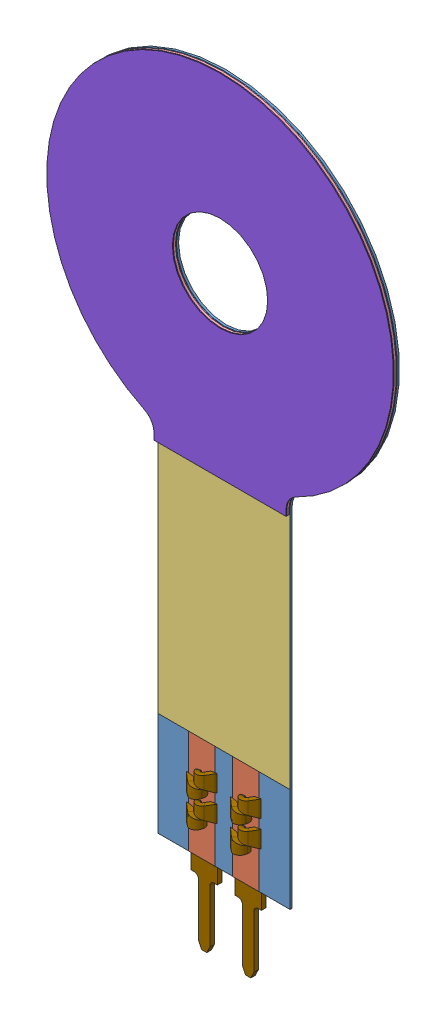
SolidWorks assembly FSR Model 404.SLDASM, configuration Default (file format 9000). Lengths in mm.
Overall size (20 44.68 0.85).
10 component instances, 9 part files, 25 mates.
Components (placement in the parent):
- COND_0_SUB-1: COND_0_SUB.SLDPRT [Default] at (17.4073 30.4845 29.5975) size (20 40 0.13)
- Silver traces-1: Silver traces.SLDPRT [Default] at (17.4073 30.4845 29.7245) size (17.5 38.74 0.01)
- Dielectric_0-1: Dielectric_0.SLDPRT [Default] at (17.4073 6.4848 29.7245) size (7.62 13.75 0.01)
- Semi_SUB-1: Semi_SUB.SLDPRT [Default] at (17.4073 30.4845 29.7745) size (20 20.25 0.13)
- Spacer-1: Spacer.SLDPRT [Default] at (17.4073 30.4845 29.7245) size (20 20.25 0.05)
- Actuator ADH-2: Actuator ADH.SLDPRT [Default] at (17.4073 30.4845 29.5475) x (0.997028 -0.077044 0) z (0 0 1) size (13.5 13.5 0.05)
- Actuator-3: Actuator.SLDPRT [Default] at (17.4073 30.4845 29.4205) size (13.5 13.5 0.13)
- Rear ADH-2: Rear ADH.SLDPRT [Default] at (17.4073 30.4845 29.9015) size (20 20.25 0.05)
- SolderTab-1: SolderTab.SLDPRT [Default] at (18.6753 2.4058 29.3435) x (0 1 0) z (1 0 0) size (9.53 0.85 1.83)
- SolderTab-2: SolderTab.SLDPRT [Default] at (16.1393 2.4058 29.3435) x (0 1 0) z (1 0 0) size (9.53 0.85 1.83)
Mates (geometry in assembly coordinates):
- Concentric1: concentric aligned: cylinder of COND_0_SUB-1 through (17.4073 30.4845 29.7245) axis (0 0 -1) radius 2.75; circle of Silver traces-1
- Distance1: distance anti-aligned: plane of Silver traces-1 through (15.8993 21.8654 29.7245) normal (0 0 -1); plane of COND_0_SUB-1 through (17.4073 30.4845 29.7245) normal (0 0 1)
- Concentric2: concentric aligned: circle of COND_0_SUB-1; circle of Spacer-1
- Distance2: distance anti-aligned: plane of Spacer-1 through (19.1573 22.1666 29.7245) normal (0 0 -1); plane of COND_0_SUB-1 through (17.4073 30.4845 29.7245) normal (0 0 1)
- Concentric3: concentric aligned: circle of COND_0_SUB-1; circle of Semi_SUB-1
- Coincident1: coincident anti-aligned: plane of Semi_SUB-1 through (22.2173 20.5919 29.7745) normal (0 0 -1); plane of Spacer-1 through (19.1573 22.1666 29.7745) normal (0 0 1)
- Coincident3: coincident anti-aligned: plane of COND_0_SUB-1 through (17.4073 30.4845 29.7245) normal (0 0 1); plane of Dielectric_0-1 through (17.4073 6.4848 29.7245) normal (0 0 -1)
- Coincident4: coincident aligned: plane of COND_0_SUB-1 through (21.2173 0.4848 29.7245) normal (1 0 0); plane of Dielectric_0-1 through (21.2173 20.2388 29.7345) normal (1 0 0)
- Distance3: distance = 6 mm aligned: plane of Dielectric_0-1 through (21.2173 6.4848 29.7345) normal (0 -1 0); plane of COND_0_SUB-1 through (13.5973 0.4848 29.7245) normal (0 -1 0)
- Concentric8: concentric aligned: cylinder of Semi_SUB-1 through (17.4073 30.4845 29.9015) axis (0 0 -1) radius 2.75; cylinder of Actuator ADH-2 through (17.4073 30.4845 29.5975) axis (0 0 -1) radius 4.5
- Coincident8: coincident anti-aligned: plane of COND_0_SUB-1 through (17.4073 30.4845 29.5975) normal (0 0 -1); plane of Actuator ADH-2 through (17.4073 30.4845 29.5975) normal (0 0 1)
- Concentric9: concentric aligned: cylinder of Semi_SUB-1 through (17.4073 30.4845 29.9015) axis (0 0 -1) radius 2.75; cylinder of Actuator-3 through (17.4073 30.4845 29.5475) axis (0 0 -1) radius 4.5
- Coincident9: coincident anti-aligned: plane of Actuator ADH-2 through (17.4073 30.4845 29.5475) normal (0 0 -1); plane of Actuator-3 through (17.4073 30.4845 29.5475) normal (0 0 1)
- Concentric10: concentric aligned: cylinder of Semi_SUB-1 through (17.4073 30.4845 29.9015) axis (0 0 -1) radius 2.75; cylinder of Rear ADH-2 through (17.4073 30.4845 29.9515) axis (0 0 -1) radius 2.75
- Coincident10: coincident anti-aligned: plane of Semi_SUB-1 through (22.2173 20.5919 29.9015) normal (0 0 1); plane of Rear ADH-2 through (22.2173 20.5919 29.9015) normal (0 0 -1)
- Parallel1: parallel aligned: plane of COND_0_SUB-1 through (17.4073 30.4845 29.5975) normal (0 0 -1); plane of SolderTab-1 through (18.0911 -0.7692 29.3435) normal (0 0 -1)
- Parallel2: parallel aligned: plane of COND_0_SUB-1 through (21.2173 0.4848 29.7245) normal (1 0 0); plane of SolderTab-1 through (19.4373 -0.5152 29.5975) normal (1 0 0)
- Coincident11: coincident anti-aligned: plane of COND_0_SUB-1 through (17.4073 30.4845 29.5975) normal (0 0 -1); plane of SolderTab-1 through (18.0911 -0.7692 29.5975) normal (0 0 1)
- Distance4: distance = 1.78 mm aligned: plane of SolderTab-1 through (19.4373 -0.5152 29.5975) normal (1 0 0); plane of COND_0_SUB-1 through (21.2173 0.4848 29.7245) normal (1 0 0)
- Distance5: distance = 1 mm aligned: plane of SolderTab-1 through (19.2595 -0.5152 29.5975) normal (0 -1 0); plane of COND_0_SUB-1 through (13.5973 0.4848 29.7245) normal (0 -1 0)
- Parallel3: parallel aligned: plane of COND_0_SUB-1 through (17.4073 30.4845 29.5975) normal (0 0 -1); plane of SolderTab-2 through (15.5551 -0.7692 29.3435) normal (0 0 -1)
- Parallel4: parallel aligned: plane of COND_0_SUB-1 through (21.2173 0.4848 29.7245) normal (1 0 0); plane of SolderTab-2 through (16.9013 -0.5152 29.5975) normal (1 0 0)
- Coincident13: coincident anti-aligned: plane of COND_0_SUB-1 through (17.4073 30.4845 29.5975) normal (0 0 -1); plane of SolderTab-2 through (15.5551 -0.7692 29.5975) normal (0 0 1)
- Distance6: distance = 1 mm aligned: plane of SolderTab-2 through (15.3773 -0.5152 29.5975) normal (0 -1 0); plane of COND_0_SUB-1 through (13.5973 0.4848 29.7245) normal (0 -1 0)
- Distance7: distance = 1.78 mm aligned: plane of SolderTab-2 through (15.3773 -0.5152 29.5975) normal (-1 0 0); plane of COND_0_SUB-1 through (13.5973 20.5919 29.7245) normal (-1 0 0)
